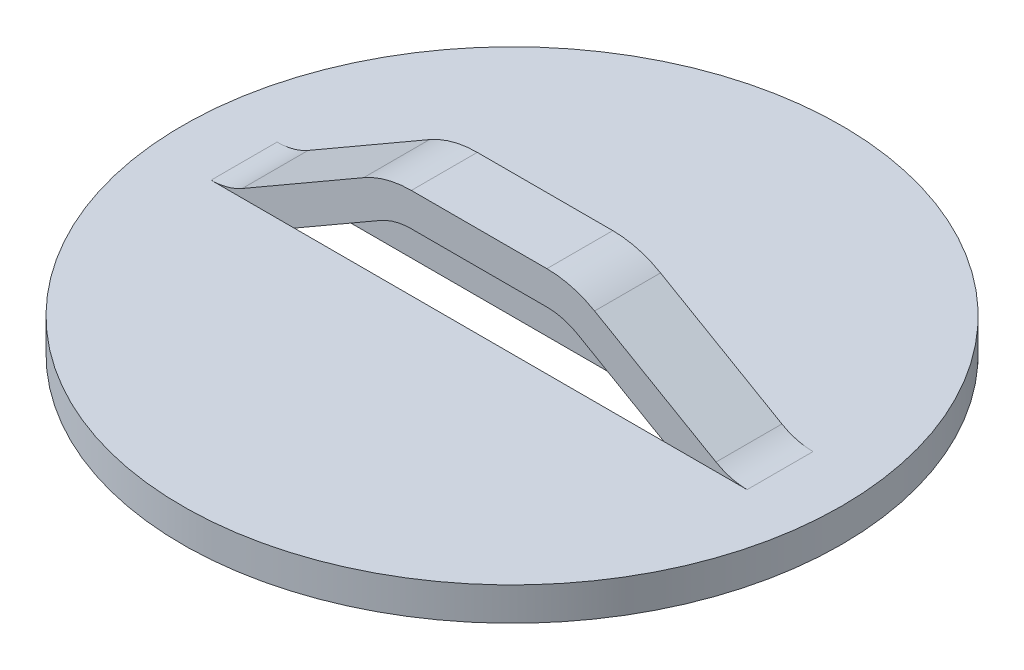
ISO-10303-21;
HEADER;
FILE_DESCRIPTION(('STEP AP214'),'2;1');
FILE_NAME('part.step','',(''),(''),'','','');
FILE_SCHEMA(('AUTOMOTIVE_DESIGN { 1 0 10303 214 1 1 1 1 }'));
ENDSEC;
DATA;
#1=APPLICATION_CONTEXT('core data for automotive mechanical design processes');
#2=APPLICATION_PROTOCOL_DEFINITION('international standard','automotive_design',2000,#1);
#3=PRODUCT_CONTEXT('',#1,'mechanical');
#4=PRODUCT('Part','Part','',(#3));
#5=PRODUCT_RELATED_PRODUCT_CATEGORY('part','',(#4));
#6=PRODUCT_DEFINITION_FORMATION('','',#4);
#7=PRODUCT_DEFINITION_CONTEXT('part definition',#1,'design');
#8=PRODUCT_DEFINITION('design','',#6,#7);
#9=PRODUCT_DEFINITION_SHAPE('','',#8);
#10=(LENGTH_UNIT() NAMED_UNIT(*) SI_UNIT(.MILLI.,.METRE.));
#11=(NAMED_UNIT(*) PLANE_ANGLE_UNIT() SI_UNIT($,.RADIAN.));
#12=(NAMED_UNIT(*) SI_UNIT($,.STERADIAN.) SOLID_ANGLE_UNIT());
#13=UNCERTAINTY_MEASURE_WITH_UNIT(LENGTH_MEASURE(1.E-05),#10,'distance_accuracy_value','');
#14=(GEOMETRIC_REPRESENTATION_CONTEXT(3) GLOBAL_UNCERTAINTY_ASSIGNED_CONTEXT((#13)) GLOBAL_UNIT_ASSIGNED_CONTEXT((#10,
#11,#12)) REPRESENTATION_CONTEXT('',''));
#15=CARTESIAN_POINT('',(0.,0.,0.));
#16=DIRECTION('',(0.,0.,1.));
#17=DIRECTION('',(1.,0.,0.));
#18=AXIS2_PLACEMENT_3D('',#15,#16,#17);
#19=CARTESIAN_POINT('',(2.96515540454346,2.9972,-3.175));
#20=DIRECTION('',(0.,0.,1.));
#21=DIRECTION('',(1.,0.,0.));
#22=AXIS2_PLACEMENT_3D('',#19,#20,#21);
#23=PLANE('',#22);
#24=DIRECTION('',(1.,0.,0.));
#25=VECTOR('',#24,1.);
#26=CARTESIAN_POINT('',(2.96515540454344,0.,-3.175));
#27=LINE('',#26,#25);
#28=CARTESIAN_POINT('',(2.96515540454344,0.,-3.175));
#29=VERTEX_POINT('',#28);
#30=CARTESIAN_POINT('',(6.96865272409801,0.,-3.175));
#31=VERTEX_POINT('',#30);
#32=EDGE_CURVE('E163',#29,#31,#27,.T.);
#33=ORIENTED_EDGE('',*,*,#32,.F.);
#34=CARTESIAN_POINT('',(2.96515540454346,2.9972,-3.175));
#35=DIRECTION('',(0.,0.,-1.));
#36=DIRECTION('',(1.,0.,0.));
#37=AXIS2_PLACEMENT_3D('',#34,#35,#36);
#38=CIRCLE('',#37,2.9972);
#39=CARTESIAN_POINT('',(4.46375540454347,0.401548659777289,-3.175));
#40=VERTEX_POINT('',#39);
#41=EDGE_CURVE('E167',#40,#29,#38,.T.);
#42=ORIENTED_EDGE('',*,*,#41,.F.);
#43=DIRECTION('',(-0.866025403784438,-0.500000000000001,0.));
#44=VECTOR('',#43,1.);
#45=CARTESIAN_POINT('',(4.46375540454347,0.401548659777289,-3.175));
#46=LINE('',#45,#44);
#47=CARTESIAN_POINT('',(10.3124,3.77826519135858,-3.175));
#48=VERTEX_POINT('',#47);
#49=EDGE_CURVE('E187',#48,#40,#46,.T.);
#50=ORIENTED_EDGE('',*,*,#49,.F.);
#51=CARTESIAN_POINT('',(12.6111,-0.203200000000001,-3.175));
#52=DIRECTION('',(0.,0.,1.));
#53=DIRECTION('',(-1.,0.,0.));
#54=AXIS2_PLACEMENT_3D('',#51,#52,#53);
#55=CIRCLE('',#54,4.5974);
#56=CARTESIAN_POINT('',(12.6111,4.3942,-3.175));
#57=VERTEX_POINT('',#56);
#58=EDGE_CURVE('E191',#57,#48,#55,.T.);
#59=ORIENTED_EDGE('',*,*,#58,.F.);
#60=DIRECTION('',(-1.,0.,0.));
#61=VECTOR('',#60,1.);
#62=CARTESIAN_POINT('',(12.6111,4.3942,-3.175));
#63=LINE('',#62,#61);
#64=CARTESIAN_POINT('',(19.1389,4.3942,-3.175));
#65=VERTEX_POINT('',#64);
#66=EDGE_CURVE('E320',#65,#57,#63,.T.);
#67=ORIENTED_EDGE('',*,*,#66,.F.);
#68=CARTESIAN_POINT('',(19.1389,-0.2032,-3.175));
#69=DIRECTION('',(0.,0.,1.));
#70=DIRECTION('',(-1.,0.,0.));
#71=AXIS2_PLACEMENT_3D('',#68,#69,#70);
#72=CIRCLE('',#71,4.5974);
#73=CARTESIAN_POINT('',(21.4376,3.77826519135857,-3.175));
#74=VERTEX_POINT('',#73);
#75=EDGE_CURVE('E317',#74,#65,#72,.T.);
#76=ORIENTED_EDGE('',*,*,#75,.F.);
#77=DIRECTION('',(-0.866025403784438,0.500000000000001,0.));
#78=VECTOR('',#77,1.);
#79=CARTESIAN_POINT('',(21.4376,3.77826519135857,-3.175));
#80=LINE('',#79,#78);
#81=CARTESIAN_POINT('',(27.2862445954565,0.40154865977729,-3.175));
#82=VERTEX_POINT('',#81);
#83=EDGE_CURVE('E314',#82,#74,#80,.T.);
#84=ORIENTED_EDGE('',*,*,#83,.F.);
#85=CARTESIAN_POINT('',(28.7848445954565,2.9972,-3.175));
#86=DIRECTION('',(0.,0.,-1.));
#87=DIRECTION('',(1.,0.,0.));
#88=AXIS2_PLACEMENT_3D('',#85,#86,#87);
#89=CIRCLE('',#88,2.9972);
#90=CARTESIAN_POINT('',(28.7848445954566,0.,-3.175));
#91=VERTEX_POINT('',#90);
#92=EDGE_CURVE('E311',#91,#82,#89,.T.);
#93=ORIENTED_EDGE('',*,*,#92,.F.);
#94=CARTESIAN_POINT('',(24.781347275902,0.,-3.175));
#95=VERTEX_POINT('',#94);
#96=EDGE_CURVE('E177',#95,#91,#27,.T.);
#97=ORIENTED_EDGE('',*,*,#96,.F.);
#98=DIRECTION('',(0.866025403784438,-0.5,0.));
#99=VECTOR('',#98,1.);
#100=CARTESIAN_POINT('',(20.6375,2.39245134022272,-3.175));
#101=LINE('',#100,#99);
#102=CARTESIAN_POINT('',(20.6375,2.39245134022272,-3.175));
#103=VERTEX_POINT('',#102);
#104=EDGE_CURVE('E305',#103,#95,#101,.T.);
#105=ORIENTED_EDGE('',*,*,#104,.F.);
#106=CARTESIAN_POINT('',(19.1389,-0.2032,-3.175));
#107=DIRECTION('',(0.,0.,-1.));
#108=DIRECTION('',(-1.,0.,0.));
#109=AXIS2_PLACEMENT_3D('',#106,#107,#108);
#110=CIRCLE('',#109,2.9972);
#111=CARTESIAN_POINT('',(19.1389,2.794,-3.175));
#112=VERTEX_POINT('',#111);
#113=EDGE_CURVE('E301',#112,#103,#110,.T.);
#114=ORIENTED_EDGE('',*,*,#113,.F.);
#115=DIRECTION('',(1.,0.,0.));
#116=VECTOR('',#115,1.);
#117=CARTESIAN_POINT('',(12.6111,2.794,-3.175));
#118=LINE('',#117,#116);
#119=CARTESIAN_POINT('',(12.6111,2.794,-3.175));
#120=VERTEX_POINT('',#119);
#121=EDGE_CURVE('E298',#120,#112,#118,.T.);
#122=ORIENTED_EDGE('',*,*,#121,.F.);
#123=CARTESIAN_POINT('',(12.6111,-0.203200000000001,-3.175));
#124=DIRECTION('',(0.,0.,-1.));
#125=DIRECTION('',(-1.,0.,0.));
#126=AXIS2_PLACEMENT_3D('',#123,#124,#125);
#127=CIRCLE('',#126,2.99719999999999);
#128=CARTESIAN_POINT('',(11.1125,2.39245134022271,-3.175));
#129=VERTEX_POINT('',#128);
#130=EDGE_CURVE('E295',#129,#120,#127,.T.);
#131=ORIENTED_EDGE('',*,*,#130,.F.);
#132=DIRECTION('',(0.866025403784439,0.5,0.));
#133=VECTOR('',#132,1.);
#134=CARTESIAN_POINT('',(5.26385540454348,-0.984265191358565,-3.175));
#135=LINE('',#134,#133);
#136=EDGE_CURVE('E170',#31,#129,#135,.T.);
#137=ORIENTED_EDGE('',*,*,#136,.F.);
#138=EDGE_LOOP('',(#33,#42,#50,#59,#67,#76,#84,#93,#97,#105,#114,#122,#131,#137));
#139=FACE_BOUND('',#138,.T.);
#140=ADVANCED_FACE('F37',(#139),#23,.F.);
#141=CARTESIAN_POINT('',(2.96515540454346,2.9972,0.));
#142=DIRECTION('',(0.,0.,1.));
#143=DIRECTION('',(1.,0.,0.));
#144=AXIS2_PLACEMENT_3D('',#141,#142,#143);
#145=PLANE('',#144);
#146=CARTESIAN_POINT('',(2.96515540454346,2.9972,0.));
#147=DIRECTION('',(0.,0.,-1.));
#148=DIRECTION('',(1.,0.,0.));
#149=AXIS2_PLACEMENT_3D('',#146,#147,#148);
#150=CIRCLE('',#149,2.9972);
#151=CARTESIAN_POINT('',(4.46375540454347,0.401548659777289,0.));
#152=VERTEX_POINT('',#151);
#153=CARTESIAN_POINT('',(2.96515540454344,0.,0.));
#154=VERTEX_POINT('',#153);
#155=EDGE_CURVE('E235',#152,#154,#150,.T.);
#156=ORIENTED_EDGE('',*,*,#155,.T.);
#157=DIRECTION('',(1.,0.,0.));
#158=VECTOR('',#157,1.);
#159=CARTESIAN_POINT('',(2.96515540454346,0.,0.));
#160=LINE('',#159,#158);
#161=CARTESIAN_POINT('',(6.96865272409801,0.,0.));
#162=VERTEX_POINT('',#161);
#163=EDGE_CURVE('E11',#154,#162,#160,.T.);
#164=ORIENTED_EDGE('',*,*,#163,.T.);
#165=DIRECTION('',(0.866025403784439,0.5,0.));
#166=VECTOR('',#165,1.);
#167=CARTESIAN_POINT('',(5.26385540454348,-0.984265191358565,0.));
#168=LINE('',#167,#166);
#169=CARTESIAN_POINT('',(11.1125,2.39245134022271,0.));
#170=VERTEX_POINT('',#169);
#171=EDGE_CURVE('E198',#162,#170,#168,.T.);
#172=ORIENTED_EDGE('',*,*,#171,.T.);
#173=CARTESIAN_POINT('',(12.6111,-0.203200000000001,0.));
#174=DIRECTION('',(0.,0.,-1.));
#175=DIRECTION('',(-1.,0.,0.));
#176=AXIS2_PLACEMENT_3D('',#173,#174,#175);
#177=CIRCLE('',#176,2.99719999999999);
#178=CARTESIAN_POINT('',(12.6111,2.794,0.));
#179=VERTEX_POINT('',#178);
#180=EDGE_CURVE('E203',#170,#179,#177,.T.);
#181=ORIENTED_EDGE('',*,*,#180,.T.);
#182=DIRECTION('',(1.,0.,0.));
#183=VECTOR('',#182,1.);
#184=CARTESIAN_POINT('',(12.6111,2.794,0.));
#185=LINE('',#184,#183);
#186=CARTESIAN_POINT('',(19.1389,2.794,0.));
#187=VERTEX_POINT('',#186);
#188=EDGE_CURVE('E206',#179,#187,#185,.T.);
#189=ORIENTED_EDGE('',*,*,#188,.T.);
#190=CARTESIAN_POINT('',(19.1389,-0.2032,0.));
#191=DIRECTION('',(0.,0.,-1.));
#192=DIRECTION('',(-1.,0.,0.));
#193=AXIS2_PLACEMENT_3D('',#190,#191,#192);
#194=CIRCLE('',#193,2.9972);
#195=CARTESIAN_POINT('',(20.6375,2.39245134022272,0.));
#196=VERTEX_POINT('',#195);
#197=EDGE_CURVE('E209',#187,#196,#194,.T.);
#198=ORIENTED_EDGE('',*,*,#197,.T.);
#199=DIRECTION('',(0.866025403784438,-0.5,0.));
#200=VECTOR('',#199,1.);
#201=CARTESIAN_POINT('',(20.6375,2.39245134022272,0.));
#202=LINE('',#201,#200);
#203=CARTESIAN_POINT('',(24.781347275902,0.,0.));
#204=VERTEX_POINT('',#203);
#205=EDGE_CURVE('E212',#196,#204,#202,.T.);
#206=ORIENTED_EDGE('',*,*,#205,.T.);
#207=DIRECTION('',(-1.,0.,0.));
#208=VECTOR('',#207,1.);
#209=CARTESIAN_POINT('',(2.96515540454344,0.,0.));
#210=LINE('',#209,#208);
#211=CARTESIAN_POINT('',(28.7848445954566,0.,0.));
#212=VERTEX_POINT('',#211);
#213=EDGE_CURVE('E291',#212,#204,#210,.T.);
#214=ORIENTED_EDGE('',*,*,#213,.F.);
#215=CARTESIAN_POINT('',(28.7848445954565,2.9972,0.));
#216=DIRECTION('',(0.,0.,-1.));
#217=DIRECTION('',(1.,0.,0.));
#218=AXIS2_PLACEMENT_3D('',#215,#216,#217);
#219=CIRCLE('',#218,2.9972);
#220=CARTESIAN_POINT('',(27.2862445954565,0.40154865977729,0.));
#221=VERTEX_POINT('',#220);
#222=EDGE_CURVE('E217',#212,#221,#219,.T.);
#223=ORIENTED_EDGE('',*,*,#222,.T.);
#224=DIRECTION('',(-0.866025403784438,0.500000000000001,0.));
#225=VECTOR('',#224,1.);
#226=CARTESIAN_POINT('',(21.4376,3.77826519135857,0.));
#227=LINE('',#226,#225);
#228=CARTESIAN_POINT('',(21.4376,3.77826519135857,0.));
#229=VERTEX_POINT('',#228);
#230=EDGE_CURVE('E220',#221,#229,#227,.T.);
#231=ORIENTED_EDGE('',*,*,#230,.T.);
#232=CARTESIAN_POINT('',(19.1389,-0.2032,0.));
#233=DIRECTION('',(0.,0.,1.));
#234=DIRECTION('',(-1.,0.,0.));
#235=AXIS2_PLACEMENT_3D('',#232,#233,#234);
#236=CIRCLE('',#235,4.5974);
#237=CARTESIAN_POINT('',(19.1389,4.3942,0.));
#238=VERTEX_POINT('',#237);
#239=EDGE_CURVE('E223',#229,#238,#236,.T.);
#240=ORIENTED_EDGE('',*,*,#239,.T.);
#241=DIRECTION('',(-1.,0.,0.));
#242=VECTOR('',#241,1.);
#243=CARTESIAN_POINT('',(12.6111,4.3942,0.));
#244=LINE('',#243,#242);
#245=CARTESIAN_POINT('',(12.6111,4.3942,0.));
#246=VERTEX_POINT('',#245);
#247=EDGE_CURVE('E226',#238,#246,#244,.T.);
#248=ORIENTED_EDGE('',*,*,#247,.T.);
#249=CARTESIAN_POINT('',(12.6111,-0.203200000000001,0.));
#250=DIRECTION('',(0.,0.,1.));
#251=DIRECTION('',(-1.,0.,0.));
#252=AXIS2_PLACEMENT_3D('',#249,#250,#251);
#253=CIRCLE('',#252,4.5974);
#254=CARTESIAN_POINT('',(10.3124,3.77826519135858,0.));
#255=VERTEX_POINT('',#254);
#256=EDGE_CURVE('E229',#246,#255,#253,.T.);
#257=ORIENTED_EDGE('',*,*,#256,.T.);
#258=DIRECTION('',(-0.866025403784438,-0.500000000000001,0.));
#259=VECTOR('',#258,1.);
#260=CARTESIAN_POINT('',(4.46375540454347,0.401548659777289,0.));
#261=LINE('',#260,#259);
#262=EDGE_CURVE('E232',#255,#152,#261,.T.);
#263=ORIENTED_EDGE('',*,*,#262,.T.);
#264=EDGE_LOOP('',(#156,#164,#172,#181,#189,#198,#206,#214,#223,#231,#240,#248,#257,#263));
#265=FACE_BOUND('',#264,.T.);
#266=ADVANCED_FACE('F365',(#265),#145,.T.);
#267=CARTESIAN_POINT('',(0.,0.,-3.175));
#268=DIRECTION('',(0.,1.,0.));
#269=DIRECTION('',(0.,0.,1.));
#270=AXIS2_PLACEMENT_3D('',#267,#268,#269);
#271=PLANE('',#270);
#272=CARTESIAN_POINT('',(15.875,0.,-1.5875));
#273=DIRECTION('',(0.,-1.,0.));
#274=DIRECTION('',(1.,0.,0.));
#275=AXIS2_PLACEMENT_3D('',#272,#273,#274);
#276=CIRCLE('',#275,15.875);
#277=CARTESIAN_POINT('',(31.75,0.,-1.5875));
#278=VERTEX_POINT('',#277);
#279=EDGE_CURVE('E199',#278,#278,#276,.T.);
#280=ORIENTED_EDGE('',*,*,#279,.F.);
#281=EDGE_LOOP('',(#280));
#282=FACE_BOUND('',#281,.T.);
#283=DIRECTION('',(0.,0.,1.));
#284=VECTOR('',#283,1.);
#285=CARTESIAN_POINT('',(28.7848445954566,0.,-3.175));
#286=LINE('',#285,#284);
#287=EDGE_CURVE('E249',#91,#212,#286,.T.);
#288=ORIENTED_EDGE('',*,*,#287,.T.);
#289=ORIENTED_EDGE('',*,*,#213,.T.);
#290=EDGE_CURVE('E174',#204,#162,#210,.T.);
#291=ORIENTED_EDGE('',*,*,#290,.T.);
#292=ORIENTED_EDGE('',*,*,#163,.F.);
#293=DIRECTION('',(0.,0.,1.));
#294=VECTOR('',#293,1.);
#295=CARTESIAN_POINT('',(2.96515540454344,0.,-3.175));
#296=LINE('',#295,#294);
#297=EDGE_CURVE('E45',#29,#154,#296,.T.);
#298=ORIENTED_EDGE('',*,*,#297,.F.);
#299=ORIENTED_EDGE('',*,*,#32,.T.);
#300=EDGE_CURVE('E175',#31,#95,#27,.T.);
#301=ORIENTED_EDGE('',*,*,#300,.T.);
#302=ORIENTED_EDGE('',*,*,#96,.T.);
#303=EDGE_LOOP('',(#288,#289,#291,#292,#298,#299,#301,#302));
#304=FACE_BOUND('',#303,.T.);
#305=ADVANCED_FACE('F179',(#282,#304),#271,.T.);
#306=CARTESIAN_POINT('',(2.96515540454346,2.9972,-3.175));
#307=DIRECTION('',(0.,0.,1.));
#308=DIRECTION('',(1.,0.,0.));
#309=AXIS2_PLACEMENT_3D('',#306,#307,#308);
#310=CYLINDRICAL_SURFACE('',#309,2.9972);
#311=ORIENTED_EDGE('',*,*,#155,.F.);
#312=DIRECTION('',(0.,0.,1.));
#313=VECTOR('',#312,1.);
#314=CARTESIAN_POINT('',(4.46375540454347,0.401548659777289,-3.175));
#315=LINE('',#314,#313);
#316=EDGE_CURVE('E183',#40,#152,#315,.T.);
#317=ORIENTED_EDGE('',*,*,#316,.F.);
#318=ORIENTED_EDGE('',*,*,#41,.T.);
#319=ORIENTED_EDGE('',*,*,#297,.T.);
#320=EDGE_LOOP('',(#311,#317,#318,#319));
#321=FACE_BOUND('',#320,.T.);
#322=ADVANCED_FACE('F185',(#321),#310,.F.);
#323=CARTESIAN_POINT('',(4.46375540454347,0.401548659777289,-3.175));
#324=DIRECTION('',(-0.500000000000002,0.866025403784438,0.));
#325=DIRECTION('',(-0.866025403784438,-0.500000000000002,0.));
#326=AXIS2_PLACEMENT_3D('',#323,#324,#325);
#327=PLANE('',#326);
#328=ORIENTED_EDGE('',*,*,#262,.F.);
#329=DIRECTION('',(0.,0.,1.));
#330=VECTOR('',#329,1.);
#331=CARTESIAN_POINT('',(10.3124,3.77826519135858,-3.175));
#332=LINE('',#331,#330);
#333=EDGE_CURVE('E239',#48,#255,#332,.T.);
#334=ORIENTED_EDGE('',*,*,#333,.F.);
#335=ORIENTED_EDGE('',*,*,#49,.T.);
#336=ORIENTED_EDGE('',*,*,#316,.T.);
#337=EDGE_LOOP('',(#328,#334,#335,#336));
#338=FACE_BOUND('',#337,.T.);
#339=ADVANCED_FACE('F367',(#338),#327,.T.);
#340=CARTESIAN_POINT('',(12.6111,-0.203200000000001,-3.175));
#341=DIRECTION('',(0.,0.,1.));
#342=DIRECTION('',(1.,0.,0.));
#343=AXIS2_PLACEMENT_3D('',#340,#341,#342);
#344=CYLINDRICAL_SURFACE('',#343,4.5974);
#345=ORIENTED_EDGE('',*,*,#256,.F.);
#346=DIRECTION('',(0.,0.,1.));
#347=VECTOR('',#346,1.);
#348=CARTESIAN_POINT('',(12.6111,4.3942,-3.175));
#349=LINE('',#348,#347);
#350=EDGE_CURVE('E241',#57,#246,#349,.T.);
#351=ORIENTED_EDGE('',*,*,#350,.F.);
#352=ORIENTED_EDGE('',*,*,#58,.T.);
#353=ORIENTED_EDGE('',*,*,#333,.T.);
#354=EDGE_LOOP('',(#345,#351,#352,#353));
#355=FACE_BOUND('',#354,.T.);
#356=ADVANCED_FACE('F326',(#355),#344,.T.);
#357=CARTESIAN_POINT('',(12.6111,4.3942,-3.175));
#358=DIRECTION('',(0.,1.,0.));
#359=DIRECTION('',(-1.,0.,0.));
#360=AXIS2_PLACEMENT_3D('',#357,#358,#359);
#361=PLANE('',#360);
#362=ORIENTED_EDGE('',*,*,#247,.F.);
#363=DIRECTION('',(0.,0.,1.));
#364=VECTOR('',#363,1.);
#365=CARTESIAN_POINT('',(19.1389,4.3942,-3.175));
#366=LINE('',#365,#364);
#367=EDGE_CURVE('E243',#65,#238,#366,.T.);
#368=ORIENTED_EDGE('',*,*,#367,.F.);
#369=ORIENTED_EDGE('',*,*,#66,.T.);
#370=ORIENTED_EDGE('',*,*,#350,.T.);
#371=EDGE_LOOP('',(#362,#368,#369,#370));
#372=FACE_BOUND('',#371,.T.);
#373=ADVANCED_FACE('F332',(#372),#361,.T.);
#374=CARTESIAN_POINT('',(19.1389,-0.2032,-3.175));
#375=DIRECTION('',(0.,0.,1.));
#376=DIRECTION('',(1.,0.,0.));
#377=AXIS2_PLACEMENT_3D('',#374,#375,#376);
#378=CYLINDRICAL_SURFACE('',#377,4.5974);
#379=ORIENTED_EDGE('',*,*,#239,.F.);
#380=DIRECTION('',(0.,0.,1.));
#381=VECTOR('',#380,1.);
#382=CARTESIAN_POINT('',(21.4376,3.77826519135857,-3.175));
#383=LINE('',#382,#381);
#384=EDGE_CURVE('E245',#74,#229,#383,.T.);
#385=ORIENTED_EDGE('',*,*,#384,.F.);
#386=ORIENTED_EDGE('',*,*,#75,.T.);
#387=ORIENTED_EDGE('',*,*,#367,.T.);
#388=EDGE_LOOP('',(#379,#385,#386,#387));
#389=FACE_BOUND('',#388,.T.);
#390=ADVANCED_FACE('F335',(#389),#378,.T.);
#391=CARTESIAN_POINT('',(21.4376,3.77826519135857,-3.175));
#392=DIRECTION('',(0.500000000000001,0.866025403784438,0.));
#393=DIRECTION('',(-0.866025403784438,0.500000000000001,0.));
#394=AXIS2_PLACEMENT_3D('',#391,#392,#393);
#395=PLANE('',#394);
#396=ORIENTED_EDGE('',*,*,#230,.F.);
#397=DIRECTION('',(0.,0.,1.));
#398=VECTOR('',#397,1.);
#399=CARTESIAN_POINT('',(27.2862445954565,0.40154865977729,-3.175));
#400=LINE('',#399,#398);
#401=EDGE_CURVE('E247',#82,#221,#400,.T.);
#402=ORIENTED_EDGE('',*,*,#401,.F.);
#403=ORIENTED_EDGE('',*,*,#83,.T.);
#404=ORIENTED_EDGE('',*,*,#384,.T.);
#405=EDGE_LOOP('',(#396,#402,#403,#404));
#406=FACE_BOUND('',#405,.T.);
#407=ADVANCED_FACE('F340',(#406),#395,.T.);
#408=CARTESIAN_POINT('',(28.7848445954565,2.9972,-3.175));
#409=DIRECTION('',(0.,0.,1.));
#410=DIRECTION('',(1.,0.,0.));
#411=AXIS2_PLACEMENT_3D('',#408,#409,#410);
#412=CYLINDRICAL_SURFACE('',#411,2.9972);
#413=ORIENTED_EDGE('',*,*,#222,.F.);
#414=ORIENTED_EDGE('',*,*,#287,.F.);
#415=ORIENTED_EDGE('',*,*,#92,.T.);
#416=ORIENTED_EDGE('',*,*,#401,.T.);
#417=EDGE_LOOP('',(#413,#414,#415,#416));
#418=FACE_BOUND('',#417,.T.);
#419=ADVANCED_FACE('F343',(#418),#412,.F.);
#420=CARTESIAN_POINT('',(28.7848445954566,-1.6002,-3.175));
#421=DIRECTION('',(0.,-1.,0.));
#422=DIRECTION('',(1.,0.,0.));
#423=AXIS2_PLACEMENT_3D('',#420,#421,#422);
#424=PLANE('',#423);
#425=CARTESIAN_POINT('',(15.875,-1.6002,-1.5875));
#426=DIRECTION('',(0.,-1.,0.));
#427=DIRECTION('',(1.,0.,0.));
#428=AXIS2_PLACEMENT_3D('',#425,#426,#427);
#429=CIRCLE('',#428,15.875);
#430=CARTESIAN_POINT('',(31.75,-1.6002,-1.5875));
#431=VERTEX_POINT('',#430);
#432=EDGE_CURVE('E288',#431,#431,#429,.T.);
#433=ORIENTED_EDGE('',*,*,#432,.T.);
#434=EDGE_LOOP('',(#433));
#435=FACE_BOUND('',#434,.T.);
#436=DIRECTION('',(1.,0.,0.));
#437=VECTOR('',#436,1.);
#438=CARTESIAN_POINT('',(2.96515540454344,-1.6002,-3.175));
#439=LINE('',#438,#437);
#440=CARTESIAN_POINT('',(2.96515540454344,-1.6002,-3.175));
#441=VERTEX_POINT('',#440);
#442=CARTESIAN_POINT('',(28.7848445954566,-1.6002,-3.175));
#443=VERTEX_POINT('',#442);
#444=EDGE_CURVE('E281',#441,#443,#439,.T.);
#445=ORIENTED_EDGE('',*,*,#444,.F.);
#446=DIRECTION('',(0.,0.,1.));
#447=VECTOR('',#446,1.);
#448=CARTESIAN_POINT('',(2.96515540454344,-1.6002,-3.175));
#449=LINE('',#448,#447);
#450=CARTESIAN_POINT('',(2.96515540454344,-1.6002,0.));
#451=VERTEX_POINT('',#450);
#452=EDGE_CURVE('E186',#441,#451,#449,.T.);
#453=ORIENTED_EDGE('',*,*,#452,.T.);
#454=DIRECTION('',(-1.,0.,0.));
#455=VECTOR('',#454,1.);
#456=CARTESIAN_POINT('',(2.96515540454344,-1.6002,0.));
#457=LINE('',#456,#455);
#458=CARTESIAN_POINT('',(28.7848445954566,-1.6002,0.));
#459=VERTEX_POINT('',#458);
#460=EDGE_CURVE('E277',#459,#451,#457,.T.);
#461=ORIENTED_EDGE('',*,*,#460,.F.);
#462=DIRECTION('',(0.,0.,1.));
#463=VECTOR('',#462,1.);
#464=CARTESIAN_POINT('',(28.7848445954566,-1.6002,-3.175));
#465=LINE('',#464,#463);
#466=EDGE_CURVE('E251',#443,#459,#465,.T.);
#467=ORIENTED_EDGE('',*,*,#466,.F.);
#468=EDGE_LOOP('',(#445,#453,#461,#467));
#469=FACE_BOUND('',#468,.T.);
#470=ADVANCED_FACE('F396',(#435,#469),#424,.T.);
#471=CARTESIAN_POINT('',(28.7848445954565,2.9972,-3.175));
#472=DIRECTION('',(0.,0.,1.));
#473=DIRECTION('',(1.,0.,0.));
#474=AXIS2_PLACEMENT_3D('',#471,#472,#473);
#475=CYLINDRICAL_SURFACE('',#474,4.5974);
#476=CARTESIAN_POINT('',(28.7848445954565,2.9972,0.));
#477=DIRECTION('',(0.,0.,1.));
#478=DIRECTION('',(1.,0.,0.));
#479=AXIS2_PLACEMENT_3D('',#476,#477,#478);
#480=CIRCLE('',#479,4.5974);
#481=CARTESIAN_POINT('',(26.4861445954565,-0.984265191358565,0.));
#482=VERTEX_POINT('',#481);
#483=EDGE_CURVE('E214',#482,#459,#480,.T.);
#484=ORIENTED_EDGE('',*,*,#483,.F.);
#485=DIRECTION('',(0.,0.,1.));
#486=VECTOR('',#485,1.);
#487=CARTESIAN_POINT('',(26.4861445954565,-0.984265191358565,-3.175));
#488=LINE('',#487,#486);
#489=CARTESIAN_POINT('',(26.4861445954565,-0.984265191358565,-3.175));
#490=VERTEX_POINT('',#489);
#491=EDGE_CURVE('E253',#490,#482,#488,.T.);
#492=ORIENTED_EDGE('',*,*,#491,.F.);
#493=CARTESIAN_POINT('',(28.7848445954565,2.9972,-3.175));
#494=DIRECTION('',(0.,0.,1.));
#495=DIRECTION('',(1.,0.,0.));
#496=AXIS2_PLACEMENT_3D('',#493,#494,#495);
#497=CIRCLE('',#496,4.5974);
#498=EDGE_CURVE('E308',#490,#443,#497,.T.);
#499=ORIENTED_EDGE('',*,*,#498,.T.);
#500=ORIENTED_EDGE('',*,*,#466,.T.);
#501=EDGE_LOOP('',(#484,#492,#499,#500));
#502=FACE_BOUND('',#501,.T.);
#503=ADVANCED_FACE('F398',(#502),#475,.T.);
#504=CARTESIAN_POINT('',(20.6375,2.39245134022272,-3.175));
#505=DIRECTION('',(-0.5,-0.866025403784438,0.));
#506=DIRECTION('',(0.866025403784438,-0.5,0.));
#507=AXIS2_PLACEMENT_3D('',#504,#505,#506);
#508=PLANE('',#507);
#509=ORIENTED_EDGE('',*,*,#205,.F.);
#510=DIRECTION('',(0.,0.,1.));
#511=VECTOR('',#510,1.);
#512=CARTESIAN_POINT('',(20.6375,2.39245134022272,-3.175));
#513=LINE('',#512,#511);
#514=EDGE_CURVE('E255',#103,#196,#513,.T.);
#515=ORIENTED_EDGE('',*,*,#514,.F.);
#516=ORIENTED_EDGE('',*,*,#104,.T.);
#517=EDGE_CURVE('E304',#95,#490,#101,.T.);
#518=ORIENTED_EDGE('',*,*,#517,.T.);
#519=ORIENTED_EDGE('',*,*,#491,.T.);
#520=EDGE_CURVE('E52',#204,#482,#202,.T.);
#521=ORIENTED_EDGE('',*,*,#520,.F.);
#522=EDGE_LOOP('',(#509,#515,#516,#518,#519,#521));
#523=FACE_BOUND('',#522,.T.);
#524=ADVANCED_FACE('F349',(#523),#508,.T.);
#525=CARTESIAN_POINT('',(19.1389,-0.2032,-3.175));
#526=DIRECTION('',(0.,0.,1.));
#527=DIRECTION('',(1.,0.,0.));
#528=AXIS2_PLACEMENT_3D('',#525,#526,#527);
#529=CYLINDRICAL_SURFACE('',#528,2.9972);
#530=ORIENTED_EDGE('',*,*,#197,.F.);
#531=DIRECTION('',(0.,0.,1.));
#532=VECTOR('',#531,1.);
#533=CARTESIAN_POINT('',(19.1389,2.794,-3.175));
#534=LINE('',#533,#532);
#535=EDGE_CURVE('E257',#112,#187,#534,.T.);
#536=ORIENTED_EDGE('',*,*,#535,.F.);
#537=ORIENTED_EDGE('',*,*,#113,.T.);
#538=ORIENTED_EDGE('',*,*,#514,.T.);
#539=EDGE_LOOP('',(#530,#536,#537,#538));
#540=FACE_BOUND('',#539,.T.);
#541=ADVANCED_FACE('F353',(#540),#529,.F.);
#542=CARTESIAN_POINT('',(12.6111,2.794,-3.175));
#543=DIRECTION('',(0.,-1.,0.));
#544=DIRECTION('',(0.,0.,-1.));
#545=AXIS2_PLACEMENT_3D('',#542,#543,#544);
#546=PLANE('',#545);
#547=ORIENTED_EDGE('',*,*,#188,.F.);
#548=DIRECTION('',(0.,0.,1.));
#549=VECTOR('',#548,1.);
#550=CARTESIAN_POINT('',(12.6111,2.794,-3.175));
#551=LINE('',#550,#549);
#552=EDGE_CURVE('E259',#120,#179,#551,.T.);
#553=ORIENTED_EDGE('',*,*,#552,.F.);
#554=ORIENTED_EDGE('',*,*,#121,.T.);
#555=ORIENTED_EDGE('',*,*,#535,.T.);
#556=EDGE_LOOP('',(#547,#553,#554,#555));
#557=FACE_BOUND('',#556,.T.);
#558=ADVANCED_FACE('F357',(#557),#546,.T.);
#559=CARTESIAN_POINT('',(12.6111,-0.203200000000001,-3.175));
#560=DIRECTION('',(0.,0.,1.));
#561=DIRECTION('',(1.,0.,0.));
#562=AXIS2_PLACEMENT_3D('',#559,#560,#561);
#563=CYLINDRICAL_SURFACE('',#562,2.99719999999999);
#564=ORIENTED_EDGE('',*,*,#180,.F.);
#565=DIRECTION('',(0.,0.,1.));
#566=VECTOR('',#565,1.);
#567=CARTESIAN_POINT('',(11.1125,2.39245134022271,-3.175));
#568=LINE('',#567,#566);
#569=EDGE_CURVE('E261',#129,#170,#568,.T.);
#570=ORIENTED_EDGE('',*,*,#569,.F.);
#571=ORIENTED_EDGE('',*,*,#130,.T.);
#572=ORIENTED_EDGE('',*,*,#552,.T.);
#573=EDGE_LOOP('',(#564,#570,#571,#572));
#574=FACE_BOUND('',#573,.T.);
#575=ADVANCED_FACE('F360',(#574),#563,.F.);
#576=CARTESIAN_POINT('',(5.26385540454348,-0.984265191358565,-3.175));
#577=DIRECTION('',(0.5,-0.866025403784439,0.));
#578=DIRECTION('',(0.866025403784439,0.5,0.));
#579=AXIS2_PLACEMENT_3D('',#576,#577,#578);
#580=PLANE('',#579);
#581=CARTESIAN_POINT('',(5.26385540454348,-0.984265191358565,0.));
#582=VERTEX_POINT('',#581);
#583=EDGE_CURVE('E200',#582,#162,#168,.T.);
#584=ORIENTED_EDGE('',*,*,#583,.F.);
#585=DIRECTION('',(0.,0.,1.));
#586=VECTOR('',#585,1.);
#587=CARTESIAN_POINT('',(5.26385540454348,-0.984265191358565,-3.175));
#588=LINE('',#587,#586);
#589=CARTESIAN_POINT('',(5.26385540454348,-0.984265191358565,-3.175));
#590=VERTEX_POINT('',#589);
#591=EDGE_CURVE('E190',#590,#582,#588,.T.);
#592=ORIENTED_EDGE('',*,*,#591,.F.);
#593=EDGE_CURVE('E293',#590,#31,#135,.T.);
#594=ORIENTED_EDGE('',*,*,#593,.T.);
#595=ORIENTED_EDGE('',*,*,#136,.T.);
#596=ORIENTED_EDGE('',*,*,#569,.T.);
#597=ORIENTED_EDGE('',*,*,#171,.F.);
#598=EDGE_LOOP('',(#584,#592,#594,#595,#596,#597));
#599=FACE_BOUND('',#598,.T.);
#600=ADVANCED_FACE('F271',(#599),#580,.T.);
#601=CARTESIAN_POINT('',(2.96515540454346,2.9972,-3.175));
#602=DIRECTION('',(0.,0.,1.));
#603=DIRECTION('',(1.,0.,0.));
#604=AXIS2_PLACEMENT_3D('',#601,#602,#603);
#605=CYLINDRICAL_SURFACE('',#604,4.5974);
#606=CARTESIAN_POINT('',(2.96515540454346,2.9972,0.));
#607=DIRECTION('',(0.,0.,1.));
#608=DIRECTION('',(1.,0.,0.));
#609=AXIS2_PLACEMENT_3D('',#606,#607,#608);
#610=CIRCLE('',#609,4.5974);
#611=EDGE_CURVE('E195',#451,#582,#610,.T.);
#612=ORIENTED_EDGE('',*,*,#611,.F.);
#613=ORIENTED_EDGE('',*,*,#452,.F.);
#614=CARTESIAN_POINT('',(2.96515540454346,2.9972,-3.175));
#615=DIRECTION('',(0.,0.,1.));
#616=DIRECTION('',(1.,0.,0.));
#617=AXIS2_PLACEMENT_3D('',#614,#615,#616);
#618=CIRCLE('',#617,4.5974);
#619=EDGE_CURVE('E236',#441,#590,#618,.T.);
#620=ORIENTED_EDGE('',*,*,#619,.T.);
#621=ORIENTED_EDGE('',*,*,#591,.T.);
#622=EDGE_LOOP('',(#612,#613,#620,#621));
#623=FACE_BOUND('',#622,.T.);
#624=ADVANCED_FACE('F39',(#623),#605,.T.);
#625=CARTESIAN_POINT('',(2.96515540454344,0.,0.));
#626=DIRECTION('',(0.,0.,1.));
#627=DIRECTION('',(1.,0.,0.));
#628=AXIS2_PLACEMENT_3D('',#625,#626,#627);
#629=PLANE('',#628);
#630=ORIENTED_EDGE('',*,*,#483,.T.);
#631=ORIENTED_EDGE('',*,*,#460,.T.);
#632=ORIENTED_EDGE('',*,*,#611,.T.);
#633=ORIENTED_EDGE('',*,*,#583,.T.);
#634=ORIENTED_EDGE('',*,*,#290,.F.);
#635=ORIENTED_EDGE('',*,*,#520,.T.);
#636=EDGE_LOOP('',(#630,#631,#632,#633,#634,#635));
#637=FACE_BOUND('',#636,.T.);
#638=ADVANCED_FACE('F275',(#637),#629,.F.);
#639=CARTESIAN_POINT('',(15.875,0.,-1.5875));
#640=DIRECTION('',(0.,-1.,0.));
#641=DIRECTION('',(1.,0.,0.));
#642=AXIS2_PLACEMENT_3D('',#639,#640,#641);
#643=CYLINDRICAL_SURFACE('',#642,15.875);
#644=ORIENTED_EDGE('',*,*,#279,.T.);
#645=EDGE_LOOP('',(#644));
#646=FACE_BOUND('',#645,.T.);
#647=ORIENTED_EDGE('',*,*,#432,.F.);
#648=EDGE_LOOP('',(#647));
#649=FACE_BOUND('',#648,.T.);
#650=ADVANCED_FACE('F383',(#646,#649),#643,.T.);
#651=CARTESIAN_POINT('',(2.96515540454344,0.,-3.175));
#652=DIRECTION('',(0.,0.,-1.));
#653=DIRECTION('',(-1.,0.,0.));
#654=AXIS2_PLACEMENT_3D('',#651,#652,#653);
#655=PLANE('',#654);
#656=ORIENTED_EDGE('',*,*,#498,.F.);
#657=ORIENTED_EDGE('',*,*,#517,.F.);
#658=ORIENTED_EDGE('',*,*,#300,.F.);
#659=ORIENTED_EDGE('',*,*,#593,.F.);
#660=ORIENTED_EDGE('',*,*,#619,.F.);
#661=ORIENTED_EDGE('',*,*,#444,.T.);
#662=EDGE_LOOP('',(#656,#657,#658,#659,#660,#661));
#663=FACE_BOUND('',#662,.T.);
#664=ADVANCED_FACE('F363',(#663),#655,.F.);
#665=CLOSED_SHELL('',(#140,#266,#305,#322,#339,#356,#373,#390,#407,#419,#470,#503,#524,#541,
#558,#575,#600,#624,#638,#650,#664));
#666=MANIFOLD_SOLID_BREP('B2',#665);
#667=ADVANCED_BREP_SHAPE_REPRESENTATION('',(#18,#666),#14);
#668=SHAPE_DEFINITION_REPRESENTATION(#9,#667);
ENDSEC;
END-ISO-10303-21;
